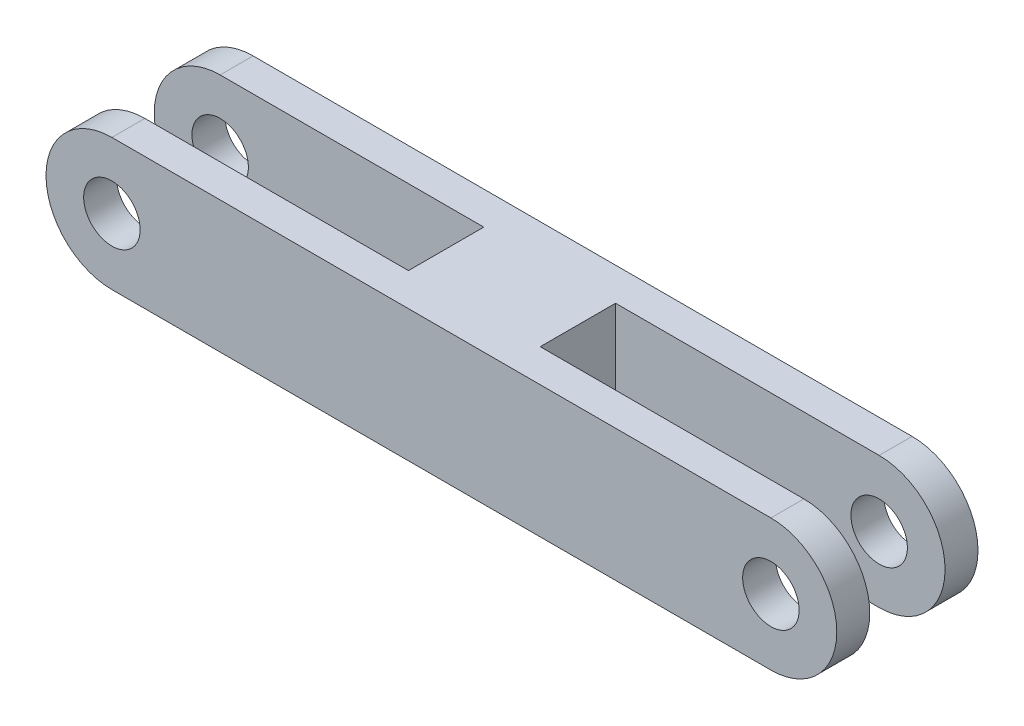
ISO-10303-21;
HEADER;
FILE_DESCRIPTION(('STEP AP214'),'2;1');
FILE_NAME('part.step','',(''),(''),'','','');
FILE_SCHEMA(('AUTOMOTIVE_DESIGN { 1 0 10303 214 1 1 1 1 }'));
ENDSEC;
DATA;
#1=APPLICATION_CONTEXT('core data for automotive mechanical design processes');
#2=APPLICATION_PROTOCOL_DEFINITION('international standard','automotive_design',2000,#1);
#3=PRODUCT_CONTEXT('',#1,'mechanical');
#4=PRODUCT('Part','Part','',(#3));
#5=PRODUCT_RELATED_PRODUCT_CATEGORY('part','',(#4));
#6=PRODUCT_DEFINITION_FORMATION('','',#4);
#7=PRODUCT_DEFINITION_CONTEXT('part definition',#1,'design');
#8=PRODUCT_DEFINITION('design','',#6,#7);
#9=PRODUCT_DEFINITION_SHAPE('','',#8);
#10=(LENGTH_UNIT() NAMED_UNIT(*) SI_UNIT(.MILLI.,.METRE.));
#11=(NAMED_UNIT(*) PLANE_ANGLE_UNIT() SI_UNIT($,.RADIAN.));
#12=(NAMED_UNIT(*) SI_UNIT($,.STERADIAN.) SOLID_ANGLE_UNIT());
#13=UNCERTAINTY_MEASURE_WITH_UNIT(LENGTH_MEASURE(1.E-05),#10,'distance_accuracy_value','');
#14=(GEOMETRIC_REPRESENTATION_CONTEXT(3) GLOBAL_UNCERTAINTY_ASSIGNED_CONTEXT((#13)) GLOBAL_UNIT_ASSIGNED_CONTEXT((#10,
#11,#12)) REPRESENTATION_CONTEXT('',''));
#15=CARTESIAN_POINT('',(0.,0.,0.));
#16=DIRECTION('',(0.,0.,1.));
#17=DIRECTION('',(1.,0.,0.));
#18=AXIS2_PLACEMENT_3D('',#15,#16,#17);
#19=CARTESIAN_POINT('',(0.,0.,7.5));
#20=DIRECTION('',(0.,0.,-1.));
#21=DIRECTION('',(-1.,0.,0.));
#22=AXIS2_PLACEMENT_3D('',#19,#20,#21);
#23=CYLINDRICAL_SURFACE('',#22,7.);
#24=CARTESIAN_POINT('',(0.,0.,-3.99999999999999));
#25=DIRECTION('',(0.,0.,-1.));
#26=DIRECTION('',(-1.,0.,0.));
#27=AXIS2_PLACEMENT_3D('',#24,#25,#26);
#28=CIRCLE('',#27,7.);
#29=CARTESIAN_POINT('',(0.,-7.,-3.99999999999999));
#30=VERTEX_POINT('',#29);
#31=CARTESIAN_POINT('',(0.,7.,-3.99999999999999));
#32=VERTEX_POINT('',#31);
#33=EDGE_CURVE('E157',#30,#32,#28,.T.);
#34=ORIENTED_EDGE('',*,*,#33,.T.);
#35=DIRECTION('',(0.,0.,-1.));
#36=VECTOR('',#35,1.);
#37=CARTESIAN_POINT('',(0.,7.,7.5));
#38=LINE('',#37,#36);
#39=CARTESIAN_POINT('',(0.,7.,-7.5));
#40=VERTEX_POINT('',#39);
#41=EDGE_CURVE('E219',#32,#40,#38,.T.);
#42=ORIENTED_EDGE('',*,*,#41,.T.);
#43=CARTESIAN_POINT('',(0.,0.,-7.5));
#44=DIRECTION('',(0.,0.,1.));
#45=DIRECTION('',(-1.,0.,0.));
#46=AXIS2_PLACEMENT_3D('',#43,#44,#45);
#47=CIRCLE('',#46,7.);
#48=CARTESIAN_POINT('',(0.,-7.,-7.5));
#49=VERTEX_POINT('',#48);
#50=EDGE_CURVE('E198',#40,#49,#47,.T.);
#51=ORIENTED_EDGE('',*,*,#50,.T.);
#52=DIRECTION('',(0.,0.,-1.));
#53=VECTOR('',#52,1.);
#54=CARTESIAN_POINT('',(0.,-7.,7.5));
#55=LINE('',#54,#53);
#56=EDGE_CURVE('E42',#30,#49,#55,.T.);
#57=ORIENTED_EDGE('',*,*,#56,.F.);
#58=EDGE_LOOP('',(#34,#42,#51,#57));
#59=FACE_BOUND('',#58,.T.);
#60=ADVANCED_FACE('F33',(#59),#23,.T.);
#61=CARTESIAN_POINT('',(0.,0.,7.5));
#62=DIRECTION('',(0.,0.,-1.));
#63=DIRECTION('',(-1.,0.,0.));
#64=AXIS2_PLACEMENT_3D('',#61,#62,#63);
#65=CYLINDRICAL_SURFACE('',#64,3.);
#66=CARTESIAN_POINT('',(0.,0.,-3.99999999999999));
#67=DIRECTION('',(0.,0.,-1.));
#68=DIRECTION('',(-1.,0.,0.));
#69=AXIS2_PLACEMENT_3D('',#66,#67,#68);
#70=CIRCLE('',#69,3.);
#71=CARTESIAN_POINT('',(-3.,0.,-3.99999999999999));
#72=VERTEX_POINT('',#71);
#73=EDGE_CURVE('E37',#72,#72,#70,.T.);
#74=ORIENTED_EDGE('',*,*,#73,.F.);
#75=EDGE_LOOP('',(#74));
#76=FACE_BOUND('',#75,.T.);
#77=CARTESIAN_POINT('',(0.,0.,-7.5));
#78=DIRECTION('',(0.,0.,1.));
#79=DIRECTION('',(1.,0.,0.));
#80=AXIS2_PLACEMENT_3D('',#77,#78,#79);
#81=CIRCLE('',#80,3.);
#82=CARTESIAN_POINT('',(3.,0.,-7.5));
#83=VERTEX_POINT('',#82);
#84=EDGE_CURVE('E192',#83,#83,#81,.T.);
#85=ORIENTED_EDGE('',*,*,#84,.F.);
#86=EDGE_LOOP('',(#85));
#87=FACE_BOUND('',#86,.T.);
#88=ADVANCED_FACE('F242',(#76,#87),#65,.F.);
#89=CARTESIAN_POINT('',(70.,0.,7.5));
#90=DIRECTION('',(0.,0.,-1.));
#91=DIRECTION('',(-1.,0.,0.));
#92=AXIS2_PLACEMENT_3D('',#89,#90,#91);
#93=CYLINDRICAL_SURFACE('',#92,7.);
#94=CARTESIAN_POINT('',(70.,0.,4.));
#95=DIRECTION('',(0.,0.,1.));
#96=DIRECTION('',(1.,0.,0.));
#97=AXIS2_PLACEMENT_3D('',#94,#95,#96);
#98=CIRCLE('',#97,7.);
#99=CARTESIAN_POINT('',(70.,-7.,4.));
#100=VERTEX_POINT('',#99);
#101=CARTESIAN_POINT('',(70.,7.,4.));
#102=VERTEX_POINT('',#101);
#103=EDGE_CURVE('E184',#100,#102,#98,.T.);
#104=ORIENTED_EDGE('',*,*,#103,.T.);
#105=DIRECTION('',(0.,0.,-1.));
#106=VECTOR('',#105,1.);
#107=CARTESIAN_POINT('',(70.,7.,7.5));
#108=LINE('',#107,#106);
#109=CARTESIAN_POINT('',(70.,7.,7.5));
#110=VERTEX_POINT('',#109);
#111=EDGE_CURVE('E223',#110,#102,#108,.T.);
#112=ORIENTED_EDGE('',*,*,#111,.F.);
#113=CARTESIAN_POINT('',(70.,0.,7.5));
#114=DIRECTION('',(0.,0.,1.));
#115=DIRECTION('',(1.,0.,0.));
#116=AXIS2_PLACEMENT_3D('',#113,#114,#115);
#117=CIRCLE('',#116,7.);
#118=CARTESIAN_POINT('',(70.,-7.,7.5));
#119=VERTEX_POINT('',#118);
#120=EDGE_CURVE('E215',#119,#110,#117,.T.);
#121=ORIENTED_EDGE('',*,*,#120,.F.);
#122=DIRECTION('',(0.,0.,-1.));
#123=VECTOR('',#122,1.);
#124=CARTESIAN_POINT('',(70.,-7.,7.5));
#125=LINE('',#124,#123);
#126=EDGE_CURVE('E227',#119,#100,#125,.T.);
#127=ORIENTED_EDGE('',*,*,#126,.T.);
#128=EDGE_LOOP('',(#104,#112,#121,#127));
#129=FACE_BOUND('',#128,.T.);
#130=ADVANCED_FACE('F257',(#129),#93,.T.);
#131=CARTESIAN_POINT('',(70.,0.,7.5));
#132=DIRECTION('',(0.,0.,-1.));
#133=DIRECTION('',(-1.,0.,0.));
#134=AXIS2_PLACEMENT_3D('',#131,#132,#133);
#135=CYLINDRICAL_SURFACE('',#134,3.00000000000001);
#136=CARTESIAN_POINT('',(70.,0.,4.));
#137=DIRECTION('',(0.,0.,1.));
#138=DIRECTION('',(1.,0.,0.));
#139=AXIS2_PLACEMENT_3D('',#136,#137,#138);
#140=CIRCLE('',#139,3.00000000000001);
#141=CARTESIAN_POINT('',(73.,0.,4.));
#142=VERTEX_POINT('',#141);
#143=EDGE_CURVE('E183',#142,#142,#140,.T.);
#144=ORIENTED_EDGE('',*,*,#143,.F.);
#145=EDGE_LOOP('',(#144));
#146=FACE_BOUND('',#145,.T.);
#147=CARTESIAN_POINT('',(70.,0.,7.5));
#148=DIRECTION('',(0.,0.,1.));
#149=DIRECTION('',(1.,0.,0.));
#150=AXIS2_PLACEMENT_3D('',#147,#148,#149);
#151=CIRCLE('',#150,3.00000000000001);
#152=CARTESIAN_POINT('',(73.,0.,7.5));
#153=VERTEX_POINT('',#152);
#154=EDGE_CURVE('E189',#153,#153,#151,.T.);
#155=ORIENTED_EDGE('',*,*,#154,.T.);
#156=EDGE_LOOP('',(#155));
#157=FACE_BOUND('',#156,.T.);
#158=ADVANCED_FACE('F249',(#146,#157),#135,.F.);
#159=CARTESIAN_POINT('',(0.,0.,7.5));
#160=DIRECTION('',(0.,0.,-1.));
#161=DIRECTION('',(-1.,0.,0.));
#162=AXIS2_PLACEMENT_3D('',#159,#160,#161);
#163=PLANE('',#162);
#164=CARTESIAN_POINT('',(0.,0.,7.5));
#165=DIRECTION('',(0.,0.,1.));
#166=DIRECTION('',(1.,0.,0.));
#167=AXIS2_PLACEMENT_3D('',#164,#165,#166);
#168=CIRCLE('',#167,3.);
#169=CARTESIAN_POINT('',(3.,0.,7.5));
#170=VERTEX_POINT('',#169);
#171=EDGE_CURVE('E195',#170,#170,#168,.T.);
#172=ORIENTED_EDGE('',*,*,#171,.F.);
#173=EDGE_LOOP('',(#172));
#174=FACE_BOUND('',#173,.T.);
#175=CARTESIAN_POINT('',(0.,0.,7.5));
#176=DIRECTION('',(0.,0.,1.));
#177=DIRECTION('',(-1.,0.,0.));
#178=AXIS2_PLACEMENT_3D('',#175,#176,#177);
#179=CIRCLE('',#178,7.);
#180=CARTESIAN_POINT('',(0.,7.,7.5));
#181=VERTEX_POINT('',#180);
#182=CARTESIAN_POINT('',(0.,-7.,7.5));
#183=VERTEX_POINT('',#182);
#184=EDGE_CURVE('E210',#181,#183,#179,.T.);
#185=ORIENTED_EDGE('',*,*,#184,.T.);
#186=DIRECTION('',(1.,0.,0.));
#187=VECTOR('',#186,1.);
#188=CARTESIAN_POINT('',(0.,-7.,7.5));
#189=LINE('',#188,#187);
#190=EDGE_CURVE('E213',#183,#119,#189,.T.);
#191=ORIENTED_EDGE('',*,*,#190,.T.);
#192=ORIENTED_EDGE('',*,*,#120,.T.);
#193=DIRECTION('',(-1.,0.,0.));
#194=VECTOR('',#193,1.);
#195=CARTESIAN_POINT('',(0.,7.,7.5));
#196=LINE('',#195,#194);
#197=EDGE_CURVE('E217',#110,#181,#196,.T.);
#198=ORIENTED_EDGE('',*,*,#197,.T.);
#199=EDGE_LOOP('',(#185,#191,#192,#198));
#200=FACE_BOUND('',#199,.T.);
#201=ORIENTED_EDGE('',*,*,#154,.F.);
#202=EDGE_LOOP('',(#201));
#203=FACE_BOUND('',#202,.T.);
#204=ADVANCED_FACE('F245',(#174,#200,#203),#163,.F.);
#205=CARTESIAN_POINT('',(0.,0.,-7.5));
#206=DIRECTION('',(0.,0.,-1.));
#207=DIRECTION('',(-1.,0.,0.));
#208=AXIS2_PLACEMENT_3D('',#205,#206,#207);
#209=PLANE('',#208);
#210=ORIENTED_EDGE('',*,*,#84,.T.);
#211=EDGE_LOOP('',(#210));
#212=FACE_BOUND('',#211,.T.);
#213=ORIENTED_EDGE('',*,*,#50,.F.);
#214=DIRECTION('',(-1.,0.,0.));
#215=VECTOR('',#214,1.);
#216=CARTESIAN_POINT('',(0.,7.,-7.5));
#217=LINE('',#216,#215);
#218=CARTESIAN_POINT('',(70.,7.,-7.5));
#219=VERTEX_POINT('',#218);
#220=EDGE_CURVE('E207',#219,#40,#217,.T.);
#221=ORIENTED_EDGE('',*,*,#220,.F.);
#222=CARTESIAN_POINT('',(70.,0.,-7.5));
#223=DIRECTION('',(0.,0.,1.));
#224=DIRECTION('',(1.,0.,0.));
#225=AXIS2_PLACEMENT_3D('',#222,#223,#224);
#226=CIRCLE('',#225,7.);
#227=CARTESIAN_POINT('',(70.,-7.,-7.5));
#228=VERTEX_POINT('',#227);
#229=EDGE_CURVE('E204',#228,#219,#226,.T.);
#230=ORIENTED_EDGE('',*,*,#229,.F.);
#231=DIRECTION('',(1.,0.,0.));
#232=VECTOR('',#231,1.);
#233=CARTESIAN_POINT('',(0.,-7.,-7.5));
#234=LINE('',#233,#232);
#235=EDGE_CURVE('E201',#49,#228,#234,.T.);
#236=ORIENTED_EDGE('',*,*,#235,.F.);
#237=EDGE_LOOP('',(#213,#221,#230,#236));
#238=FACE_BOUND('',#237,.T.);
#239=CARTESIAN_POINT('',(70.,0.,-7.5));
#240=DIRECTION('',(0.,0.,1.));
#241=DIRECTION('',(1.,0.,0.));
#242=AXIS2_PLACEMENT_3D('',#239,#240,#241);
#243=CIRCLE('',#242,3.00000000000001);
#244=CARTESIAN_POINT('',(73.,0.,-7.5));
#245=VERTEX_POINT('',#244);
#246=EDGE_CURVE('E186',#245,#245,#243,.T.);
#247=ORIENTED_EDGE('',*,*,#246,.T.);
#248=EDGE_LOOP('',(#247));
#249=FACE_BOUND('',#248,.T.);
#250=ADVANCED_FACE('F248',(#212,#238,#249),#209,.T.);
#251=CARTESIAN_POINT('',(0.,7.,4.00000000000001));
#252=VERTEX_POINT('',#251);
#253=EDGE_CURVE('E220',#181,#252,#38,.T.);
#254=ORIENTED_EDGE('',*,*,#253,.T.);
#255=CARTESIAN_POINT('',(0.,0.,4.00000000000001));
#256=DIRECTION('',(0.,0.,1.));
#257=DIRECTION('',(1.,0.,0.));
#258=AXIS2_PLACEMENT_3D('',#255,#256,#257);
#259=CIRCLE('',#258,7.);
#260=CARTESIAN_POINT('',(0.,-7.,4.00000000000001));
#261=VERTEX_POINT('',#260);
#262=EDGE_CURVE('E50',#252,#261,#259,.T.);
#263=ORIENTED_EDGE('',*,*,#262,.T.);
#264=EDGE_CURVE('E11',#183,#261,#55,.T.);
#265=ORIENTED_EDGE('',*,*,#264,.F.);
#266=ORIENTED_EDGE('',*,*,#184,.F.);
#267=EDGE_LOOP('',(#254,#263,#265,#266));
#268=FACE_BOUND('',#267,.T.);
#269=ADVANCED_FACE('F35',(#268),#23,.T.);
#270=CARTESIAN_POINT('',(0.,-7.,7.5));
#271=DIRECTION('',(0.,1.,0.));
#272=DIRECTION('',(0.,0.,1.));
#273=AXIS2_PLACEMENT_3D('',#270,#271,#272);
#274=PLANE('',#273);
#275=DIRECTION('',(0.,0.,-1.));
#276=VECTOR('',#275,1.);
#277=CARTESIAN_POINT('',(28.,-7.,-4.));
#278=LINE('',#277,#276);
#279=CARTESIAN_POINT('',(28.,-7.,4.));
#280=VERTEX_POINT('',#279);
#281=CARTESIAN_POINT('',(28.,-7.,-4.));
#282=VERTEX_POINT('',#281);
#283=EDGE_CURVE('E138',#280,#282,#278,.T.);
#284=ORIENTED_EDGE('',*,*,#283,.T.);
#285=DIRECTION('',(-1.,0.,0.));
#286=VECTOR('',#285,1.);
#287=CARTESIAN_POINT('',(-7.00000000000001,-7.,-3.99999999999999));
#288=LINE('',#287,#286);
#289=EDGE_CURVE('E145',#282,#30,#288,.T.);
#290=ORIENTED_EDGE('',*,*,#289,.T.);
#291=ORIENTED_EDGE('',*,*,#56,.T.);
#292=ORIENTED_EDGE('',*,*,#235,.T.);
#293=CARTESIAN_POINT('',(70.,-7.,-4.));
#294=VERTEX_POINT('',#293);
#295=EDGE_CURVE('E226',#294,#228,#125,.T.);
#296=ORIENTED_EDGE('',*,*,#295,.F.);
#297=DIRECTION('',(-1.,0.,0.));
#298=VECTOR('',#297,1.);
#299=CARTESIAN_POINT('',(77.,-7.,-4.));
#300=LINE('',#299,#298);
#301=CARTESIAN_POINT('',(42.,-7.,-4.));
#302=VERTEX_POINT('',#301);
#303=EDGE_CURVE('E167',#294,#302,#300,.T.);
#304=ORIENTED_EDGE('',*,*,#303,.T.);
#305=DIRECTION('',(0.,0.,1.));
#306=VECTOR('',#305,1.);
#307=CARTESIAN_POINT('',(42.,-7.,-4.));
#308=LINE('',#307,#306);
#309=CARTESIAN_POINT('',(42.,-7.,4.));
#310=VERTEX_POINT('',#309);
#311=EDGE_CURVE('E170',#302,#310,#308,.T.);
#312=ORIENTED_EDGE('',*,*,#311,.T.);
#313=DIRECTION('',(1.,0.,0.));
#314=VECTOR('',#313,1.);
#315=CARTESIAN_POINT('',(77.,-7.,4.));
#316=LINE('',#315,#314);
#317=EDGE_CURVE('E173',#310,#100,#316,.T.);
#318=ORIENTED_EDGE('',*,*,#317,.T.);
#319=ORIENTED_EDGE('',*,*,#126,.F.);
#320=ORIENTED_EDGE('',*,*,#190,.F.);
#321=ORIENTED_EDGE('',*,*,#264,.T.);
#322=DIRECTION('',(1.,0.,0.));
#323=VECTOR('',#322,1.);
#324=CARTESIAN_POINT('',(-7.00000000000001,-7.,4.00000000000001));
#325=LINE('',#324,#323);
#326=EDGE_CURVE('E148',#261,#280,#325,.T.);
#327=ORIENTED_EDGE('',*,*,#326,.T.);
#328=EDGE_LOOP('',(#284,#290,#291,#292,#296,#304,#312,#318,#319,#320,#321,#327));
#329=FACE_BOUND('',#328,.T.);
#330=ADVANCED_FACE('F278',(#329),#274,.F.);
#331=CARTESIAN_POINT('',(70.,7.,-4.));
#332=VERTEX_POINT('',#331);
#333=EDGE_CURVE('E222',#332,#219,#108,.T.);
#334=ORIENTED_EDGE('',*,*,#333,.F.);
#335=CARTESIAN_POINT('',(70.,0.,-4.));
#336=DIRECTION('',(0.,0.,-1.));
#337=DIRECTION('',(-1.,0.,0.));
#338=AXIS2_PLACEMENT_3D('',#335,#336,#337);
#339=CIRCLE('',#338,7.);
#340=EDGE_CURVE('E58',#332,#294,#339,.T.);
#341=ORIENTED_EDGE('',*,*,#340,.T.);
#342=ORIENTED_EDGE('',*,*,#295,.T.);
#343=ORIENTED_EDGE('',*,*,#229,.T.);
#344=EDGE_LOOP('',(#334,#341,#342,#343));
#345=FACE_BOUND('',#344,.T.);
#346=ADVANCED_FACE('F265',(#345),#93,.T.);
#347=CARTESIAN_POINT('',(0.,7.,7.5));
#348=DIRECTION('',(0.,-1.,0.));
#349=DIRECTION('',(0.,0.,-1.));
#350=AXIS2_PLACEMENT_3D('',#347,#348,#349);
#351=PLANE('',#350);
#352=ORIENTED_EDGE('',*,*,#41,.F.);
#353=DIRECTION('',(-1.,0.,0.));
#354=VECTOR('',#353,1.);
#355=CARTESIAN_POINT('',(-7.00000000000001,7.,-3.99999999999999));
#356=LINE('',#355,#354);
#357=CARTESIAN_POINT('',(28.,7.,-4.));
#358=VERTEX_POINT('',#357);
#359=EDGE_CURVE('E131',#358,#32,#356,.T.);
#360=ORIENTED_EDGE('',*,*,#359,.F.);
#361=DIRECTION('',(0.,0.,-1.));
#362=VECTOR('',#361,1.);
#363=CARTESIAN_POINT('',(28.,7.,-4.));
#364=LINE('',#363,#362);
#365=CARTESIAN_POINT('',(28.,7.,4.));
#366=VERTEX_POINT('',#365);
#367=EDGE_CURVE('E130',#366,#358,#364,.T.);
#368=ORIENTED_EDGE('',*,*,#367,.F.);
#369=DIRECTION('',(1.,0.,0.));
#370=VECTOR('',#369,1.);
#371=CARTESIAN_POINT('',(-7.00000000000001,7.,4.00000000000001));
#372=LINE('',#371,#370);
#373=EDGE_CURVE('E121',#252,#366,#372,.T.);
#374=ORIENTED_EDGE('',*,*,#373,.F.);
#375=ORIENTED_EDGE('',*,*,#253,.F.);
#376=ORIENTED_EDGE('',*,*,#197,.F.);
#377=ORIENTED_EDGE('',*,*,#111,.T.);
#378=DIRECTION('',(1.,0.,0.));
#379=VECTOR('',#378,1.);
#380=CARTESIAN_POINT('',(77.,7.,4.));
#381=LINE('',#380,#379);
#382=CARTESIAN_POINT('',(42.,7.,4.));
#383=VERTEX_POINT('',#382);
#384=EDGE_CURVE('E164',#383,#102,#381,.T.);
#385=ORIENTED_EDGE('',*,*,#384,.F.);
#386=DIRECTION('',(0.,0.,1.));
#387=VECTOR('',#386,1.);
#388=CARTESIAN_POINT('',(42.,7.,-4.));
#389=LINE('',#388,#387);
#390=CARTESIAN_POINT('',(42.,7.,-4.));
#391=VERTEX_POINT('',#390);
#392=EDGE_CURVE('E161',#391,#383,#389,.T.);
#393=ORIENTED_EDGE('',*,*,#392,.F.);
#394=DIRECTION('',(-1.,0.,0.));
#395=VECTOR('',#394,1.);
#396=CARTESIAN_POINT('',(77.,7.,-4.));
#397=LINE('',#396,#395);
#398=EDGE_CURVE('E159',#332,#391,#397,.T.);
#399=ORIENTED_EDGE('',*,*,#398,.F.);
#400=ORIENTED_EDGE('',*,*,#333,.T.);
#401=ORIENTED_EDGE('',*,*,#220,.T.);
#402=EDGE_LOOP('',(#352,#360,#368,#374,#375,#376,#377,#385,#393,#399,#400,#401));
#403=FACE_BOUND('',#402,.T.);
#404=ADVANCED_FACE('F143',(#403),#351,.F.);
#405=CARTESIAN_POINT('',(0.,0.,4.00000000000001));
#406=DIRECTION('',(0.,0.,1.));
#407=DIRECTION('',(1.,0.,0.));
#408=AXIS2_PLACEMENT_3D('',#405,#406,#407);
#409=CIRCLE('',#408,3.);
#410=CARTESIAN_POINT('',(3.,0.,4.00000000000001));
#411=VERTEX_POINT('',#410);
#412=EDGE_CURVE('E154',#411,#411,#409,.T.);
#413=ORIENTED_EDGE('',*,*,#412,.F.);
#414=EDGE_LOOP('',(#413));
#415=FACE_BOUND('',#414,.T.);
#416=ORIENTED_EDGE('',*,*,#171,.T.);
#417=EDGE_LOOP('',(#416));
#418=FACE_BOUND('',#417,.T.);
#419=ADVANCED_FACE('F237',(#415,#418),#65,.F.);
#420=CARTESIAN_POINT('',(70.,0.,-4.));
#421=DIRECTION('',(0.,0.,-1.));
#422=DIRECTION('',(-1.,0.,0.));
#423=AXIS2_PLACEMENT_3D('',#420,#421,#422);
#424=CIRCLE('',#423,3.00000000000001);
#425=CARTESIAN_POINT('',(67.,0.,-4.));
#426=VERTEX_POINT('',#425);
#427=EDGE_CURVE('E179',#426,#426,#424,.T.);
#428=ORIENTED_EDGE('',*,*,#427,.F.);
#429=EDGE_LOOP('',(#428));
#430=FACE_BOUND('',#429,.T.);
#431=ORIENTED_EDGE('',*,*,#246,.F.);
#432=EDGE_LOOP('',(#431));
#433=FACE_BOUND('',#432,.T.);
#434=ADVANCED_FACE('F240',(#430,#433),#135,.F.);
#435=CARTESIAN_POINT('',(77.,-7.,4.));
#436=DIRECTION('',(0.,0.,1.));
#437=DIRECTION('',(1.,0.,0.));
#438=AXIS2_PLACEMENT_3D('',#435,#436,#437);
#439=PLANE('',#438);
#440=ORIENTED_EDGE('',*,*,#143,.T.);
#441=EDGE_LOOP('',(#440));
#442=FACE_BOUND('',#441,.T.);
#443=ORIENTED_EDGE('',*,*,#103,.F.);
#444=ORIENTED_EDGE('',*,*,#317,.F.);
#445=DIRECTION('',(0.,1.,0.));
#446=VECTOR('',#445,1.);
#447=CARTESIAN_POINT('',(42.,-7.,4.));
#448=LINE('',#447,#446);
#449=EDGE_CURVE('E177',#310,#383,#448,.T.);
#450=ORIENTED_EDGE('',*,*,#449,.T.);
#451=ORIENTED_EDGE('',*,*,#384,.T.);
#452=EDGE_LOOP('',(#443,#444,#450,#451));
#453=FACE_BOUND('',#452,.T.);
#454=ADVANCED_FACE('F269',(#442,#453),#439,.F.);
#455=CARTESIAN_POINT('',(77.,-7.,-4.));
#456=DIRECTION('',(0.,0.,-1.));
#457=DIRECTION('',(-1.,0.,0.));
#458=AXIS2_PLACEMENT_3D('',#455,#456,#457);
#459=PLANE('',#458);
#460=ORIENTED_EDGE('',*,*,#427,.T.);
#461=EDGE_LOOP('',(#460));
#462=FACE_BOUND('',#461,.T.);
#463=ORIENTED_EDGE('',*,*,#398,.T.);
#464=DIRECTION('',(0.,1.,0.));
#465=VECTOR('',#464,1.);
#466=CARTESIAN_POINT('',(42.,-7.,-4.));
#467=LINE('',#466,#465);
#468=EDGE_CURVE('E176',#302,#391,#467,.T.);
#469=ORIENTED_EDGE('',*,*,#468,.F.);
#470=ORIENTED_EDGE('',*,*,#303,.F.);
#471=ORIENTED_EDGE('',*,*,#340,.F.);
#472=EDGE_LOOP('',(#463,#469,#470,#471));
#473=FACE_BOUND('',#472,.T.);
#474=ADVANCED_FACE('F299',(#462,#473),#459,.F.);
#475=CARTESIAN_POINT('',(42.,-7.,-4.));
#476=DIRECTION('',(-1.,0.,0.));
#477=DIRECTION('',(0.,0.,1.));
#478=AXIS2_PLACEMENT_3D('',#475,#476,#477);
#479=PLANE('',#478);
#480=ORIENTED_EDGE('',*,*,#392,.T.);
#481=ORIENTED_EDGE('',*,*,#449,.F.);
#482=ORIENTED_EDGE('',*,*,#311,.F.);
#483=ORIENTED_EDGE('',*,*,#468,.T.);
#484=EDGE_LOOP('',(#480,#481,#482,#483));
#485=FACE_BOUND('',#484,.T.);
#486=ADVANCED_FACE('F297',(#485),#479,.F.);
#487=CARTESIAN_POINT('',(-7.00000000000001,-7.,-3.99999999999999));
#488=DIRECTION('',(0.,0.,-1.));
#489=DIRECTION('',(-1.,0.,0.));
#490=AXIS2_PLACEMENT_3D('',#487,#488,#489);
#491=PLANE('',#490);
#492=ORIENTED_EDGE('',*,*,#73,.T.);
#493=EDGE_LOOP('',(#492));
#494=FACE_BOUND('',#493,.T.);
#495=ORIENTED_EDGE('',*,*,#33,.F.);
#496=ORIENTED_EDGE('',*,*,#289,.F.);
#497=DIRECTION('',(0.,1.,0.));
#498=VECTOR('',#497,1.);
#499=CARTESIAN_POINT('',(28.,-7.,-4.));
#500=LINE('',#499,#498);
#501=EDGE_CURVE('E140',#282,#358,#500,.T.);
#502=ORIENTED_EDGE('',*,*,#501,.T.);
#503=ORIENTED_EDGE('',*,*,#359,.T.);
#504=EDGE_LOOP('',(#495,#496,#502,#503));
#505=FACE_BOUND('',#504,.T.);
#506=ADVANCED_FACE('F311',(#494,#505),#491,.F.);
#507=CARTESIAN_POINT('',(-7.00000000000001,-7.,4.00000000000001));
#508=DIRECTION('',(0.,0.,1.));
#509=DIRECTION('',(1.,0.,0.));
#510=AXIS2_PLACEMENT_3D('',#507,#508,#509);
#511=PLANE('',#510);
#512=ORIENTED_EDGE('',*,*,#412,.T.);
#513=EDGE_LOOP('',(#512));
#514=FACE_BOUND('',#513,.T.);
#515=ORIENTED_EDGE('',*,*,#373,.T.);
#516=DIRECTION('',(0.,1.,0.));
#517=VECTOR('',#516,1.);
#518=CARTESIAN_POINT('',(28.,-7.,4.));
#519=LINE('',#518,#517);
#520=EDGE_CURVE('E124',#280,#366,#519,.T.);
#521=ORIENTED_EDGE('',*,*,#520,.F.);
#522=ORIENTED_EDGE('',*,*,#326,.F.);
#523=ORIENTED_EDGE('',*,*,#262,.F.);
#524=EDGE_LOOP('',(#515,#521,#522,#523));
#525=FACE_BOUND('',#524,.T.);
#526=ADVANCED_FACE('F123',(#514,#525),#511,.F.);
#527=CARTESIAN_POINT('',(28.,-7.,-4.));
#528=DIRECTION('',(1.,0.,0.));
#529=DIRECTION('',(0.,0.,-1.));
#530=AXIS2_PLACEMENT_3D('',#527,#528,#529);
#531=PLANE('',#530);
#532=ORIENTED_EDGE('',*,*,#367,.T.);
#533=ORIENTED_EDGE('',*,*,#501,.F.);
#534=ORIENTED_EDGE('',*,*,#283,.F.);
#535=ORIENTED_EDGE('',*,*,#520,.T.);
#536=EDGE_LOOP('',(#532,#533,#534,#535));
#537=FACE_BOUND('',#536,.T.);
#538=ADVANCED_FACE('F135',(#537),#531,.F.);
#539=CLOSED_SHELL('',(#60,#88,#130,#158,#204,#250,#269,#330,#346,#404,#419,#434,#454,#474,#486,
#506,#526,#538));
#540=MANIFOLD_SOLID_BREP('B2',#539);
#541=ADVANCED_BREP_SHAPE_REPRESENTATION('',(#18,#540),#14);
#542=SHAPE_DEFINITION_REPRESENTATION(#9,#541);
ENDSEC;
END-ISO-10303-21;
